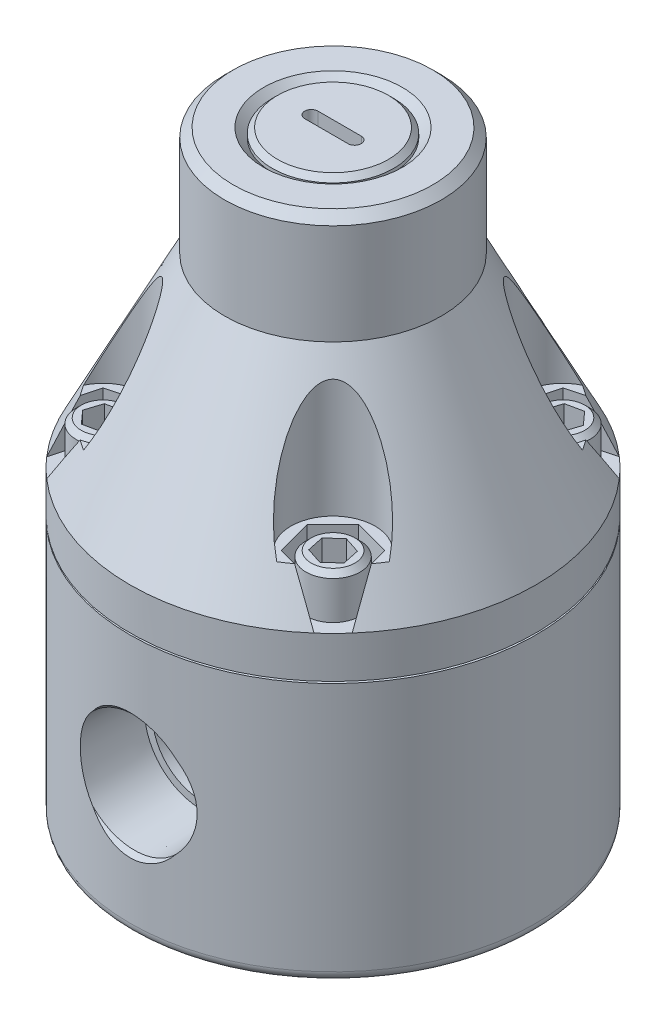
from build123d import *

# Parameters (mm, degrees)
SKETCH1_R                    = 29.718
EXTRUDE1_DEPTH               = 87.63
SKETCH3_R                    = 10.16
EXTRUDE2_DEPTH               = 1.27
EXTRUDE2_DRAFT               = -45
CIRPATTERN1_COUNT            = 2
CHAMFER1_SIZE                = 1.27
FILLET1_R                    = 1.524
EXTRUDE4_REACH               = 99.187
SKETCH7_R                    = 8.89
EXTRUDE5_DEPTH               = 4.7498
CHAMFER4_SIZE                = 0.762
SKETCH11_R                   = 6.1722
EXTRUDE6_DEPTH               = 21.2598
CIRPATTERN2_COUNT            = 4
EXTRUDE7_DEPTH               = 6.35
CIRPATTERN3_COUNT            = 4
SKETCH13_R                   = 3.9624
EXTRUDE8_DEPTH               = 6.35
EXTRUDE9_DEPTH               = 3.175
CHAMFER5_SIZE                = 0.762
CIRPATTERN4_COUNT            = 4
CHAMFER5_OF_CIRPATTERN4_SIZE = 0.762


with BuildPart() as part:
    # Sketch1 → Extrude1 (new body)
    with BuildSketch(Plane(origin=(0, 0, 0), x_dir=(1, 0, 0), z_dir=(0, 1, 0))):
        with Locations(Location((0, 0, 0), (0, 0, 270))):
            Circle(SKETCH1_R)
    extrude(amount=EXTRUDE1_DEPTH)

    # Sketch2 → Cut-Revolve1 (revolve, cut)
    with BuildSketch(Plane.XY, mode=Mode.PRIVATE) as cut_revolve1_sk:
        Polygon((-34.543868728, 38.1), (-19.05, 38.1), (-19.05, 38.354), (-29.718, 38.354), (-29.718, 44.45), (-15.875, 71.628), (-15.875, 89.288493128), (-34.543868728, 89.288493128), align=None)
    revolve(cut_revolve1_sk.sketch.rotate(Axis((0, 0, 0), (0, 1, 0)), 270), axis=Axis((0, 0, 0), (0, 1, 0)), mode=Mode.SUBTRACT)


with BuildPart() as extrude2_tool:
    # Sketch3 → Extrude2 (with draft: the straight prism first)
    with BuildSketch(Plane(origin=(0, 87.63, 0), x_dir=(-1, 0, 0), z_dir=(0, 1, 0))):
        Circle(SKETCH3_R)
    extrude(amount=-EXTRUDE2_DEPTH)
    # Extrude2: the draft: its side faces are tilted about the plane it starts from
    extrude2_sides = [extrude2_tool.faces().sort_by_distance(p)[0] for p in [
        (10.16, 86.995, 0),
    ]]
    draft(extrude2_sides, Plane(origin=(0, 87.63, 0), x_dir=(-1, 0, 0), z_dir=(0, 1, 0)), EXTRUDE2_DRAFT)


with BuildPart() as part_1:
    add(part.part)

    # Extrude2: cut by extrude2_tool
    add(extrude2_tool.part, mode=Mode.SUBTRACT)

    # Sketch6 → 3_8 NPT Tapped Hole1 (revolve, cut)
    with BuildSketch(Plane(origin=(0, 19.05, 29.718), x_dir=(0, -1, 0), z_dir=(1, 0, 0))):
        Polygon((0, 0), (0, 20.48240788), (7.1374, 17.526), (7.1374, 10.414), (8.282218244, 10.414), (8.5750146, 0.635), (9.2100146, 0), align=None)
    f_3_8_npt_tapped_hole1 = revolve(axis=Axis((0, 19.05, 36.068), (0, 0, -1)), mode=Mode.SUBTRACT)

    # CirPattern1: 3_8 NPT Tapped Hole1 ×2 about axis
    cirpattern1_axis = Axis((0, 87.63, 0), (0, -1, 0))
    for i in range(1, CIRPATTERN1_COUNT):
        add(f_3_8_npt_tapped_hole1.rotate(cirpattern1_axis, i * 360 / CIRPATTERN1_COUNT), mode=Mode.SUBTRACT)

    # Chamfer1
    chamfer1_edges = [part_1.edges().sort_by_distance(p)[0] for p in [
        (0, 87.63, 15.875),
    ]]
    chamfer(chamfer1_edges, length=CHAMFER1_SIZE)

    # Fillet1
    fillet1_edges = [part_1.edges().sort_by_distance(p)[0] for p in [
        (0, 0, -29.718),
    ]]
    fillet(fillet1_edges, radius=FILLET1_R)

    # Extrude4: up to this cone (the profile starts inside it)
    extrude4_end = Plane(origin=(0, 87.63, 0), z_dir=(0, 1, 0)).offset(-10.159999) * Cone(1e-06, 120.007, 120.006999, align=(Align.CENTER, Align.CENTER, Align.MIN), mode=Mode.PRIVATE)
    # Sketch7 → Extrude4 (add, up to the surface)
    with BuildSketch(Plane(origin=(0, 87.63, 0), x_dir=(-1, 0, 0), z_dir=(0, 1, 0)), mode=Mode.PRIVATE) as extrude4_sk1:
        with Locations(Location((0, 0, 0), (0, 0, 90))):
            Circle(SKETCH7_R)
    extrude4_tool1 = extrude(extrude4_sk1.sketch, amount=-EXTRUDE4_REACH, mode=Mode.PRIVATE) & extrude4_end
    add(extrude4_tool1.solids().sort_by_distance((0, 87.63, 0))[0])

    # Sketch10 → Extrude5 (cut)
    with BuildSketch(Plane(origin=(0, 87.63, 0), x_dir=(-1, 0, 0), z_dir=(0, 1, 0))):
        with BuildLine():
            Line((-3.175, 0.9652), (3.175, 0.9652))
            ThreePointArc((3.175, 0.9652), (4.1402, 0), (3.175, -0.9652))
            Line((3.175, -0.9652), (-3.175, -0.9652))
            ThreePointArc((-3.175, -0.9652), (-4.1402, 0), (-3.175, 0.9652))
        make_face()
    extrude(amount=-EXTRUDE5_DEPTH, mode=Mode.SUBTRACT)

    # Chamfer4
    chamfer4_edges = [part_1.edges().sort_by_distance(p)[0] for p in [
        (0, 87.63, -8.89),
    ]]
    chamfer(chamfer4_edges, length=CHAMFER4_SIZE)

    # Sketch11 → Extrude6 (cut)
    with BuildSketch(Plane(origin=(0, 50.8, 0), x_dir=(-1, 0, 0), z_dir=(0, 1, 0))):
        with Locations((-16.837980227, -16.837980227)):
            Circle(SKETCH11_R)
    extrude6 = extrude(amount=EXTRUDE6_DEPTH, mode=Mode.SUBTRACT)

    # CirPattern2: Extrude6 ×4 about axis
    cirpattern2_axis = Axis((0, 0, 0), (0, 1, 0))
    for i in range(1, CIRPATTERN2_COUNT):
        add(extrude6.rotate(cirpattern2_axis, i * 360 / CIRPATTERN2_COUNT), mode=Mode.SUBTRACT)

    # Sketch12 → Extrude7 (cut)
    with BuildSketch(Plane(origin=(0, 50.8, 0), x_dir=(-1, 0, 0), z_dir=(0, 1, 0))):
        Polygon((-20.625559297, -13.064574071), (-23.373711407, -23.398259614), (-13.050401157, -20.611386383), (-11.676325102, -15.444543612), (-15.463904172, -11.671137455), align=None)
    extrude7 = extrude(amount=-EXTRUDE7_DEPTH, mode=Mode.SUBTRACT)

    # CirPattern3: Extrude7 ×4 about axis
    cirpattern3_axis = Axis((0, 0, 0), (0, 1, 0))
    for i in range(1, CIRPATTERN3_COUNT):
        add(extrude7.rotate(cirpattern3_axis, i * 360 / CIRPATTERN3_COUNT), mode=Mode.SUBTRACT)

    # Sketch13 → Extrude8 (add)
    with BuildSketch(Plane(origin=(0, 50.8, 0), x_dir=(-1, 0, 0), z_dir=(0, 1, 0))):
        with Locations(Location((-16.832776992, -16.843181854, 0), (0, 0, 90))):
            Circle(SKETCH13_R)
    extrude8 = extrude(amount=-EXTRUDE8_DEPTH)

    # Sketch14 → Extrude9 (cut)
    with BuildSketch(Plane(origin=(0, 50.8, 0), x_dir=(-1, 0, 0), z_dir=(0, 1, 0))):
        Polygon((-15.143118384, -18.718782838), (-14.36362959, -16.317695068), (-16.053288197, -14.442094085), (-18.5224356, -14.967580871), (-19.301924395, -17.368668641), (-17.612265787, -19.244269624), align=None)
    extrude9 = extrude(amount=-EXTRUDE9_DEPTH, mode=Mode.SUBTRACT)

    # Chamfer5
    chamfer5_edges = [part_1.edges().sort_by_distance(p)[0] for p in [
        (16.832776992, 50.8, -20.805581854),
    ]]
    chamfer(chamfer5_edges, length=CHAMFER5_SIZE)

    # CirPattern4: Extrude8, Extrude9 ×4 about axis
    cirpattern4_axis = Axis((0, 0, 0), (0, 1, 0))
    add([extrude8.rotate(cirpattern4_axis, i * 360 / CIRPATTERN4_COUNT) for i in range(1, CIRPATTERN4_COUNT)])
    add([extrude9.rotate(cirpattern4_axis, i * 360 / CIRPATTERN4_COUNT) for i in range(1, CIRPATTERN4_COUNT)], mode=Mode.SUBTRACT)

    # Chamfer5 of CirPattern4
    chamfer5_of_cirpattern4_edges = [part_1.edges().sort_by_distance(p)[0] for p in [
        (-20.805581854, 50.8, -16.832776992),
        (-16.832776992, 50.8, 20.805581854),
        (20.805581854, 50.8, 16.832776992),
    ]]
    chamfer(chamfer5_of_cirpattern4_edges, length=CHAMFER5_OF_CIRPATTERN4_SIZE)

    # Sketch20 → 3_8 NPT Tapped Hole2 (revolve, cut)
    with BuildSketch(Plane(origin=(0, 0, 0), x_dir=(0, 0, -1), z_dir=(1, 0, 0))):
        Polygon((0, 0), (0, 20.48240788), (7.1374, 17.526), (7.1374, 10.414), (8.282218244, 10.414), (8.5750146, 0.635), (9.2100146, 0), align=None)
    revolve(axis=Axis((0, -6.35, 0), (0, 1, 0)), mode=Mode.SUBTRACT)


solid = part_1.part
